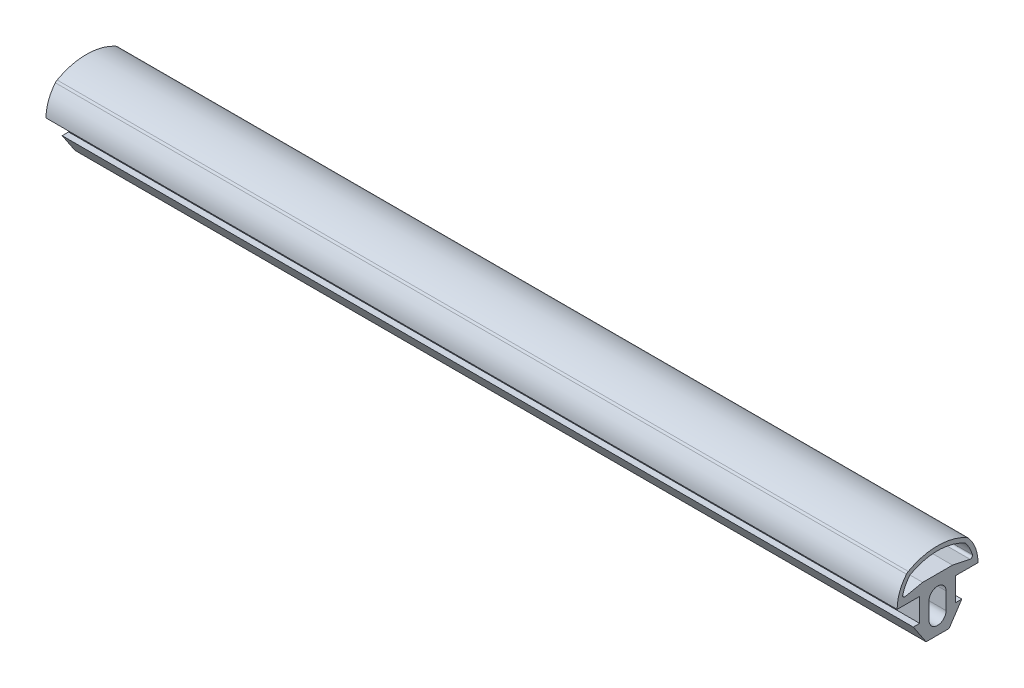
ISO-10303-21;
HEADER;
FILE_DESCRIPTION(('STEP AP214'),'2;1');
FILE_NAME('part.step','',(''),(''),'','','');
FILE_SCHEMA(('AUTOMOTIVE_DESIGN { 1 0 10303 214 1 1 1 1 }'));
ENDSEC;
DATA;
#1=APPLICATION_CONTEXT('core data for automotive mechanical design processes');
#2=APPLICATION_PROTOCOL_DEFINITION('international standard','automotive_design',2000,#1);
#3=PRODUCT_CONTEXT('',#1,'mechanical');
#4=PRODUCT('Part','Part','',(#3));
#5=PRODUCT_RELATED_PRODUCT_CATEGORY('part','',(#4));
#6=PRODUCT_DEFINITION_FORMATION('','',#4);
#7=PRODUCT_DEFINITION_CONTEXT('part definition',#1,'design');
#8=PRODUCT_DEFINITION('design','',#6,#7);
#9=PRODUCT_DEFINITION_SHAPE('','',#8);
#10=(LENGTH_UNIT() NAMED_UNIT(*) SI_UNIT(.MILLI.,.METRE.));
#11=(NAMED_UNIT(*) PLANE_ANGLE_UNIT() SI_UNIT($,.RADIAN.));
#12=(NAMED_UNIT(*) SI_UNIT($,.STERADIAN.) SOLID_ANGLE_UNIT());
#13=UNCERTAINTY_MEASURE_WITH_UNIT(LENGTH_MEASURE(1.E-05),#10,'distance_accuracy_value','');
#14=(GEOMETRIC_REPRESENTATION_CONTEXT(3) GLOBAL_UNCERTAINTY_ASSIGNED_CONTEXT((#13)) GLOBAL_UNIT_ASSIGNED_CONTEXT((#10,
#11,#12)) REPRESENTATION_CONTEXT('',''));
#15=CARTESIAN_POINT('',(0.,0.,0.));
#16=DIRECTION('',(0.,0.,1.));
#17=DIRECTION('',(1.,0.,0.));
#18=AXIS2_PLACEMENT_3D('',#15,#16,#17);
#19=CARTESIAN_POINT('',(200.,0.96558229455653,-0.262277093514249));
#20=DIRECTION('',(-1.,0.,0.));
#21=DIRECTION('',(0.,0.,1.));
#22=AXIS2_PLACEMENT_3D('',#19,#20,#21);
#23=CYLINDRICAL_SURFACE('',#22,9.49993572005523);
#24=CARTESIAN_POINT('',(0.,0.96558229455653,-0.262277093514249));
#25=DIRECTION('',(1.,0.,0.));
#26=DIRECTION('',(0.,0.,-1.));
#27=AXIS2_PLACEMENT_3D('',#24,#25,#26);
#28=CIRCLE('',#27,9.49993572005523);
#29=CARTESIAN_POINT('',(0.,0.965554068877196,-9.76221281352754));
#30=VERTEX_POINT('',#29);
#31=CARTESIAN_POINT('',(0.,7.03070570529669,-7.57412068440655));
#32=VERTEX_POINT('',#31);
#33=EDGE_CURVE('E372',#30,#32,#28,.T.);
#34=ORIENTED_EDGE('',*,*,#33,.T.);
#35=DIRECTION('',(-1.,0.,0.));
#36=VECTOR('',#35,1.);
#37=CARTESIAN_POINT('',(200.,7.03070570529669,-7.57412068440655));
#38=LINE('',#37,#36);
#39=CARTESIAN_POINT('',(200.,7.03070570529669,-7.57412068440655));
#40=VERTEX_POINT('',#39);
#41=EDGE_CURVE('E12',#40,#32,#38,.T.);
#42=ORIENTED_EDGE('',*,*,#41,.F.);
#43=CARTESIAN_POINT('',(200.,0.96558229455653,-0.262277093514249));
#44=DIRECTION('',(1.,0.,0.));
#45=DIRECTION('',(0.,0.,-1.));
#46=AXIS2_PLACEMENT_3D('',#43,#44,#45);
#47=CIRCLE('',#46,9.49993572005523);
#48=CARTESIAN_POINT('',(200.,0.965554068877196,-9.76221281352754));
#49=VERTEX_POINT('',#48);
#50=EDGE_CURVE('E561',#49,#40,#47,.T.);
#51=ORIENTED_EDGE('',*,*,#50,.F.);
#52=DIRECTION('',(-1.,0.,0.));
#53=VECTOR('',#52,1.);
#54=CARTESIAN_POINT('',(200.,0.965554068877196,-9.76221281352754));
#55=LINE('',#54,#53);
#56=EDGE_CURVE('E413',#49,#30,#55,.T.);
#57=ORIENTED_EDGE('',*,*,#56,.T.);
#58=EDGE_LOOP('',(#34,#42,#51,#57));
#59=FACE_BOUND('',#58,.T.);
#60=ADVANCED_FACE('F91',(#59),#23,.T.);
#61=CARTESIAN_POINT('',(200.,6.07291566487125,-6.41949850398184));
#62=DIRECTION('',(-1.,0.,0.));
#63=DIRECTION('',(0.,0.,1.));
#64=AXIS2_PLACEMENT_3D('',#61,#62,#63);
#65=CYLINDRICAL_SURFACE('',#64,1.50017137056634);
#66=CARTESIAN_POINT('',(0.,6.07291566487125,-6.41949850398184));
#67=DIRECTION('',(1.,0.,0.));
#68=DIRECTION('',(0.,0.,-1.));
#69=AXIS2_PLACEMENT_3D('',#66,#67,#68);
#70=CIRCLE('',#69,1.50017137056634);
#71=CARTESIAN_POINT('',(0.,7.38496389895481,-7.14685231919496));
#72=VERTEX_POINT('',#71);
#73=EDGE_CURVE('E376',#32,#72,#70,.T.);
#74=ORIENTED_EDGE('',*,*,#73,.T.);
#75=DIRECTION('',(-1.,0.,0.));
#76=VECTOR('',#75,1.);
#77=CARTESIAN_POINT('',(200.,7.38496389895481,-7.14685231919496));
#78=LINE('',#77,#76);
#79=CARTESIAN_POINT('',(200.,7.38496389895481,-7.14685231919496));
#80=VERTEX_POINT('',#79);
#81=EDGE_CURVE('E102',#80,#72,#78,.T.);
#82=ORIENTED_EDGE('',*,*,#81,.F.);
#83=CARTESIAN_POINT('',(200.,6.07291566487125,-6.41949850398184));
#84=DIRECTION('',(1.,0.,0.));
#85=DIRECTION('',(0.,0.,-1.));
#86=AXIS2_PLACEMENT_3D('',#83,#84,#85);
#87=CIRCLE('',#86,1.50017137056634);
#88=EDGE_CURVE('E564',#40,#80,#87,.T.);
#89=ORIENTED_EDGE('',*,*,#88,.F.);
#90=ORIENTED_EDGE('',*,*,#41,.T.);
#91=EDGE_LOOP('',(#74,#82,#89,#90));
#92=FACE_BOUND('',#91,.T.);
#93=ADVANCED_FACE('F620',(#92),#65,.T.);
#94=CARTESIAN_POINT('',(200.,-5.03444593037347,-0.262213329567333));
#95=DIRECTION('',(-1.,0.,0.));
#96=DIRECTION('',(0.,0.,1.));
#97=AXIS2_PLACEMENT_3D('',#94,#95,#96);
#98=CYLINDRICAL_SURFACE('',#97,14.1999998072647);
#99=CARTESIAN_POINT('',(0.,-5.03444593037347,-0.262213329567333));
#100=DIRECTION('',(1.,0.,0.));
#101=DIRECTION('',(0.,0.,-1.));
#102=AXIS2_PLACEMENT_3D('',#99,#100,#101);
#103=CIRCLE('',#102,14.1999998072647);
#104=CARTESIAN_POINT('',(0.,7.38496286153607,6.62242753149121));
#105=VERTEX_POINT('',#104);
#106=EDGE_CURVE('E379',#72,#105,#103,.T.);
#107=ORIENTED_EDGE('',*,*,#106,.T.);
#108=DIRECTION('',(-1.,0.,0.));
#109=VECTOR('',#108,1.);
#110=CARTESIAN_POINT('',(200.,7.38496286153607,6.62242753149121));
#111=LINE('',#110,#109);
#112=CARTESIAN_POINT('',(200.,7.38496286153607,6.62242753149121));
#113=VERTEX_POINT('',#112);
#114=EDGE_CURVE('E449',#113,#105,#111,.T.);
#115=ORIENTED_EDGE('',*,*,#114,.F.);
#116=CARTESIAN_POINT('',(200.,-5.03444593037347,-0.262213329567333));
#117=DIRECTION('',(1.,0.,0.));
#118=DIRECTION('',(0.,0.,-1.));
#119=AXIS2_PLACEMENT_3D('',#116,#117,#118);
#120=CIRCLE('',#119,14.1999998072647);
#121=EDGE_CURVE('E567',#80,#113,#120,.T.);
#122=ORIENTED_EDGE('',*,*,#121,.F.);
#123=ORIENTED_EDGE('',*,*,#81,.T.);
#124=EDGE_LOOP('',(#107,#115,#122,#123));
#125=FACE_BOUND('',#124,.T.);
#126=ADVANCED_FACE('F625',(#125),#98,.T.);
#127=CARTESIAN_POINT('',(200.,6.07313879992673,5.89524695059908));
#128=DIRECTION('',(-1.,0.,0.));
#129=DIRECTION('',(0.,0.,1.));
#130=AXIS2_PLACEMENT_3D('',#127,#128,#129);
#131=CYLINDRICAL_SURFACE('',#130,1.49989131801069);
#132=CARTESIAN_POINT('',(0.,6.07313879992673,5.89524695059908));
#133=DIRECTION('',(1.,0.,0.));
#134=DIRECTION('',(0.,0.,-1.));
#135=AXIS2_PLACEMENT_3D('',#132,#133,#134);
#136=CIRCLE('',#135,1.49989131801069);
#137=CARTESIAN_POINT('',(0.,7.03070963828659,7.04968709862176));
#138=VERTEX_POINT('',#137);
#139=EDGE_CURVE('E382',#105,#138,#136,.T.);
#140=ORIENTED_EDGE('',*,*,#139,.T.);
#141=DIRECTION('',(-1.,0.,0.));
#142=VECTOR('',#141,1.);
#143=CARTESIAN_POINT('',(200.,7.03070963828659,7.04968709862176));
#144=LINE('',#143,#142);
#145=CARTESIAN_POINT('',(200.,7.03070963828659,7.04968709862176));
#146=VERTEX_POINT('',#145);
#147=EDGE_CURVE('E445',#146,#138,#144,.T.);
#148=ORIENTED_EDGE('',*,*,#147,.F.);
#149=CARTESIAN_POINT('',(200.,6.07313879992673,5.89524695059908));
#150=DIRECTION('',(1.,0.,0.));
#151=DIRECTION('',(0.,0.,-1.));
#152=AXIS2_PLACEMENT_3D('',#149,#150,#151);
#153=CIRCLE('',#152,1.49989131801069);
#154=EDGE_CURVE('E570',#113,#146,#153,.T.);
#155=ORIENTED_EDGE('',*,*,#154,.F.);
#156=ORIENTED_EDGE('',*,*,#114,.T.);
#157=EDGE_LOOP('',(#140,#148,#155,#156));
#158=FACE_BOUND('',#157,.T.);
#159=ADVANCED_FACE('F774',(#158),#131,.T.);
#160=CARTESIAN_POINT('',(200.,0.965554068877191,-0.262213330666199));
#161=DIRECTION('',(-1.,0.,0.));
#162=DIRECTION('',(0.,0.,1.));
#163=AXIS2_PLACEMENT_3D('',#160,#161,#162);
#164=CYLINDRICAL_SURFACE('',#163,9.49999999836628);
#165=CARTESIAN_POINT('',(0.,0.965554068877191,-0.262213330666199));
#166=DIRECTION('',(1.,0.,0.));
#167=DIRECTION('',(0.,0.,-1.));
#168=AXIS2_PLACEMENT_3D('',#165,#166,#167);
#169=CIRCLE('',#168,9.49999999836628);
#170=CARTESIAN_POINT('',(0.,0.965554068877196,9.23778666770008));
#171=VERTEX_POINT('',#170);
#172=EDGE_CURVE('E385',#138,#171,#169,.T.);
#173=ORIENTED_EDGE('',*,*,#172,.T.);
#174=DIRECTION('',(-1.,0.,0.));
#175=VECTOR('',#174,1.);
#176=CARTESIAN_POINT('',(200.,0.965554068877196,9.23778666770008));
#177=LINE('',#176,#175);
#178=CARTESIAN_POINT('',(200.,0.965554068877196,9.23778666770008));
#179=VERTEX_POINT('',#178);
#180=EDGE_CURVE('E441',#179,#171,#177,.T.);
#181=ORIENTED_EDGE('',*,*,#180,.F.);
#182=CARTESIAN_POINT('',(200.,0.965554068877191,-0.262213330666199));
#183=DIRECTION('',(1.,0.,0.));
#184=DIRECTION('',(0.,0.,-1.));
#185=AXIS2_PLACEMENT_3D('',#182,#183,#184);
#186=CIRCLE('',#185,9.49999999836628);
#187=EDGE_CURVE('E573',#146,#179,#186,.T.);
#188=ORIENTED_EDGE('',*,*,#187,.F.);
#189=ORIENTED_EDGE('',*,*,#147,.T.);
#190=EDGE_LOOP('',(#173,#181,#188,#189));
#191=FACE_BOUND('',#190,.T.);
#192=ADVANCED_FACE('F766',(#191),#164,.T.);
#193=CARTESIAN_POINT('',(200.,0.965554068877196,9.23778666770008));
#194=DIRECTION('',(0.,1.,0.));
#195=DIRECTION('',(0.,0.,1.));
#196=AXIS2_PLACEMENT_3D('',#193,#194,#195);
#197=PLANE('',#196);
#198=DIRECTION('',(0.,0.,-1.));
#199=VECTOR('',#198,1.);
#200=CARTESIAN_POINT('',(0.,0.965554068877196,9.23778666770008));
#201=LINE('',#200,#199);
#202=CARTESIAN_POINT('',(0.,0.965554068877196,3.93778361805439));
#203=VERTEX_POINT('',#202);
#204=EDGE_CURVE('E388',#171,#203,#201,.T.);
#205=ORIENTED_EDGE('',*,*,#204,.T.);
#206=DIRECTION('',(-1.,0.,0.));
#207=VECTOR('',#206,1.);
#208=CARTESIAN_POINT('',(200.,0.965554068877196,3.93778361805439));
#209=LINE('',#208,#207);
#210=CARTESIAN_POINT('',(200.,0.965554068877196,3.93778361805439));
#211=VERTEX_POINT('',#210);
#212=EDGE_CURVE('E437',#211,#203,#209,.T.);
#213=ORIENTED_EDGE('',*,*,#212,.F.);
#214=DIRECTION('',(0.,0.,-1.));
#215=VECTOR('',#214,1.);
#216=CARTESIAN_POINT('',(200.,0.965554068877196,9.23778666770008));
#217=LINE('',#216,#215);
#218=EDGE_CURVE('E576',#179,#211,#217,.T.);
#219=ORIENTED_EDGE('',*,*,#218,.F.);
#220=ORIENTED_EDGE('',*,*,#180,.T.);
#221=EDGE_LOOP('',(#205,#213,#219,#220));
#222=FACE_BOUND('',#221,.T.);
#223=ADVANCED_FACE('F758',(#222),#197,.F.);
#224=CARTESIAN_POINT('',(200.,0.965554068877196,3.93778361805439));
#225=DIRECTION('',(0.,0.,-1.));
#226=DIRECTION('',(-1.,0.,0.));
#227=AXIS2_PLACEMENT_3D('',#224,#225,#226);
#228=PLANE('',#227);
#229=DIRECTION('',(0.,-1.,0.));
#230=VECTOR('',#229,1.);
#231=CARTESIAN_POINT('',(0.,0.965554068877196,3.93778361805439));
#232=LINE('',#231,#230);
#233=CARTESIAN_POINT('',(0.,-4.5344459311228,3.93778361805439));
#234=VERTEX_POINT('',#233);
#235=EDGE_CURVE('E391',#203,#234,#232,.T.);
#236=ORIENTED_EDGE('',*,*,#235,.T.);
#237=DIRECTION('',(-1.,0.,0.));
#238=VECTOR('',#237,1.);
#239=CARTESIAN_POINT('',(200.,-4.5344459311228,3.93778361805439));
#240=LINE('',#239,#238);
#241=CARTESIAN_POINT('',(200.,-4.5344459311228,3.93778361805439));
#242=VERTEX_POINT('',#241);
#243=EDGE_CURVE('E433',#242,#234,#240,.T.);
#244=ORIENTED_EDGE('',*,*,#243,.F.);
#245=DIRECTION('',(0.,-1.,0.));
#246=VECTOR('',#245,1.);
#247=CARTESIAN_POINT('',(200.,0.965554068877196,3.93778361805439));
#248=LINE('',#247,#246);
#249=EDGE_CURVE('E579',#211,#242,#248,.T.);
#250=ORIENTED_EDGE('',*,*,#249,.F.);
#251=ORIENTED_EDGE('',*,*,#212,.T.);
#252=EDGE_LOOP('',(#236,#244,#250,#251));
#253=FACE_BOUND('',#252,.T.);
#254=ADVANCED_FACE('F750',(#253),#228,.F.);
#255=CARTESIAN_POINT('',(200.,-4.5344459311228,3.93778361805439));
#256=DIRECTION('',(0.,-1.,0.));
#257=DIRECTION('',(0.,0.,-1.));
#258=AXIS2_PLACEMENT_3D('',#255,#256,#257);
#259=PLANE('',#258);
#260=DIRECTION('',(0.,0.,1.));
#261=VECTOR('',#260,1.);
#262=CARTESIAN_POINT('',(0.,-4.5344459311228,3.93778361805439));
#263=LINE('',#262,#261);
#264=CARTESIAN_POINT('',(0.,-4.5344459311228,5.43778361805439));
#265=VERTEX_POINT('',#264);
#266=EDGE_CURVE('E394',#234,#265,#263,.T.);
#267=ORIENTED_EDGE('',*,*,#266,.T.);
#268=DIRECTION('',(-1.,0.,0.));
#269=VECTOR('',#268,1.);
#270=CARTESIAN_POINT('',(200.,-4.5344459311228,5.43778361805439));
#271=LINE('',#270,#269);
#272=CARTESIAN_POINT('',(200.,-4.5344459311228,5.43778361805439));
#273=VERTEX_POINT('',#272);
#274=EDGE_CURVE('E429',#273,#265,#271,.T.);
#275=ORIENTED_EDGE('',*,*,#274,.F.);
#276=DIRECTION('',(0.,0.,1.));
#277=VECTOR('',#276,1.);
#278=CARTESIAN_POINT('',(200.,-4.5344459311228,3.93778361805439));
#279=LINE('',#278,#277);
#280=EDGE_CURVE('E582',#242,#273,#279,.T.);
#281=ORIENTED_EDGE('',*,*,#280,.F.);
#282=ORIENTED_EDGE('',*,*,#243,.T.);
#283=EDGE_LOOP('',(#267,#275,#281,#282));
#284=FACE_BOUND('',#283,.T.);
#285=ADVANCED_FACE('F742',(#284),#259,.F.);
#286=CARTESIAN_POINT('',(200.,-4.5344459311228,5.43778361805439));
#287=DIRECTION('',(0.,0.554700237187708,-0.832050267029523));
#288=DIRECTION('',(0.,0.832050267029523,0.554700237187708));
#289=AXIS2_PLACEMENT_3D('',#286,#287,#288);
#290=PLANE('',#289);
#291=DIRECTION('',(0.,-0.832050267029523,-0.554700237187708));
#292=VECTOR('',#291,1.);
#293=CARTESIAN_POINT('',(0.,-4.5344459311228,5.43778361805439));
#294=LINE('',#293,#292);
#295=CARTESIAN_POINT('',(0.,-9.0344454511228,2.43778361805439));
#296=VERTEX_POINT('',#295);
#297=EDGE_CURVE('E397',#265,#296,#294,.T.);
#298=ORIENTED_EDGE('',*,*,#297,.T.);
#299=DIRECTION('',(-1.,0.,0.));
#300=VECTOR('',#299,1.);
#301=CARTESIAN_POINT('',(200.,-9.0344454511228,2.43778361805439));
#302=LINE('',#301,#300);
#303=CARTESIAN_POINT('',(200.,-9.0344454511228,2.43778361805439));
#304=VERTEX_POINT('',#303);
#305=EDGE_CURVE('E425',#304,#296,#302,.T.);
#306=ORIENTED_EDGE('',*,*,#305,.F.);
#307=DIRECTION('',(0.,-0.832050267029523,-0.554700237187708));
#308=VECTOR('',#307,1.);
#309=CARTESIAN_POINT('',(200.,-4.5344459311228,5.43778361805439));
#310=LINE('',#309,#308);
#311=EDGE_CURVE('E585',#273,#304,#310,.T.);
#312=ORIENTED_EDGE('',*,*,#311,.F.);
#313=ORIENTED_EDGE('',*,*,#274,.T.);
#314=EDGE_LOOP('',(#298,#306,#312,#313));
#315=FACE_BOUND('',#314,.T.);
#316=ADVANCED_FACE('F735',(#315),#290,.F.);
#317=CARTESIAN_POINT('',(200.,-9.0344454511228,2.43778361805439));
#318=DIRECTION('',(0.,1.,0.));
#319=DIRECTION('',(0.,0.,1.));
#320=AXIS2_PLACEMENT_3D('',#317,#318,#319);
#321=PLANE('',#320);
#322=DIRECTION('',(0.,0.,-1.));
#323=VECTOR('',#322,1.);
#324=CARTESIAN_POINT('',(0.,-9.0344454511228,2.43778361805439));
#325=LINE('',#324,#323);
#326=CARTESIAN_POINT('',(0.,-9.0344454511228,-2.96220265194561));
#327=VERTEX_POINT('',#326);
#328=EDGE_CURVE('E400',#296,#327,#325,.T.);
#329=ORIENTED_EDGE('',*,*,#328,.T.);
#330=DIRECTION('',(-1.,0.,0.));
#331=VECTOR('',#330,1.);
#332=CARTESIAN_POINT('',(200.,-9.0344454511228,-2.96220265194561));
#333=LINE('',#332,#331);
#334=CARTESIAN_POINT('',(200.,-9.0344454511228,-2.96220265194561));
#335=VERTEX_POINT('',#334);
#336=EDGE_CURVE('E421',#335,#327,#333,.T.);
#337=ORIENTED_EDGE('',*,*,#336,.F.);
#338=DIRECTION('',(0.,0.,-1.));
#339=VECTOR('',#338,1.);
#340=CARTESIAN_POINT('',(200.,-9.0344454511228,2.43778361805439));
#341=LINE('',#340,#339);
#342=EDGE_CURVE('E588',#304,#335,#341,.T.);
#343=ORIENTED_EDGE('',*,*,#342,.F.);
#344=ORIENTED_EDGE('',*,*,#305,.T.);
#345=EDGE_LOOP('',(#329,#337,#343,#344));
#346=FACE_BOUND('',#345,.T.);
#347=ADVANCED_FACE('F596',(#346),#321,.F.);
#348=CARTESIAN_POINT('',(200.,-9.0344454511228,-2.96220265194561));
#349=DIRECTION('',(0.,0.554700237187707,0.832050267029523));
#350=DIRECTION('',(0.,-0.832050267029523,0.554700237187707));
#351=AXIS2_PLACEMENT_3D('',#348,#349,#350);
#352=PLANE('',#351);
#353=DIRECTION('',(0.,0.832050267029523,-0.554700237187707));
#354=VECTOR('',#353,1.);
#355=CARTESIAN_POINT('',(0.,-9.0344454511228,-2.96220265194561));
#356=LINE('',#355,#354);
#357=CARTESIAN_POINT('',(0.,-4.5344459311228,-5.96220265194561));
#358=VERTEX_POINT('',#357);
#359=EDGE_CURVE('E403',#327,#358,#356,.T.);
#360=ORIENTED_EDGE('',*,*,#359,.T.);
#361=DIRECTION('',(-1.,0.,0.));
#362=VECTOR('',#361,1.);
#363=CARTESIAN_POINT('',(200.,-4.5344459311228,-5.96220265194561));
#364=LINE('',#363,#362);
#365=CARTESIAN_POINT('',(200.,-4.5344459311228,-5.96220265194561));
#366=VERTEX_POINT('',#365);
#367=EDGE_CURVE('E305',#366,#358,#364,.T.);
#368=ORIENTED_EDGE('',*,*,#367,.F.);
#369=DIRECTION('',(0.,0.832050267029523,-0.554700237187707));
#370=VECTOR('',#369,1.);
#371=CARTESIAN_POINT('',(200.,-9.0344454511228,-2.96220265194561));
#372=LINE('',#371,#370);
#373=EDGE_CURVE('E294',#335,#366,#372,.T.);
#374=ORIENTED_EDGE('',*,*,#373,.F.);
#375=ORIENTED_EDGE('',*,*,#336,.T.);
#376=EDGE_LOOP('',(#360,#368,#374,#375));
#377=FACE_BOUND('',#376,.T.);
#378=ADVANCED_FACE('F600',(#377),#352,.F.);
#379=CARTESIAN_POINT('',(200.,-4.5344459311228,-5.96220265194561));
#380=DIRECTION('',(0.,-1.,0.));
#381=DIRECTION('',(0.,0.,-1.));
#382=AXIS2_PLACEMENT_3D('',#379,#380,#381);
#383=PLANE('',#382);
#384=DIRECTION('',(0.,0.,1.));
#385=VECTOR('',#384,1.);
#386=CARTESIAN_POINT('',(0.,-4.5344459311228,-5.96220265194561));
#387=LINE('',#386,#385);
#388=CARTESIAN_POINT('',(0.,-4.5344459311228,-4.46220265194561));
#389=VERTEX_POINT('',#388);
#390=EDGE_CURVE('E303',#358,#389,#387,.T.);
#391=ORIENTED_EDGE('',*,*,#390,.T.);
#392=DIRECTION('',(-1.,0.,0.));
#393=VECTOR('',#392,1.);
#394=CARTESIAN_POINT('',(200.,-4.5344459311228,-4.46220265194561));
#395=LINE('',#394,#393);
#396=CARTESIAN_POINT('',(200.,-4.5344459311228,-4.46220265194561));
#397=VERTEX_POINT('',#396);
#398=EDGE_CURVE('E300',#397,#389,#395,.T.);
#399=ORIENTED_EDGE('',*,*,#398,.F.);
#400=DIRECTION('',(0.,0.,1.));
#401=VECTOR('',#400,1.);
#402=CARTESIAN_POINT('',(200.,-4.5344459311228,-5.96220265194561));
#403=LINE('',#402,#401);
#404=EDGE_CURVE('E288',#366,#397,#403,.T.);
#405=ORIENTED_EDGE('',*,*,#404,.F.);
#406=ORIENTED_EDGE('',*,*,#367,.T.);
#407=EDGE_LOOP('',(#391,#399,#405,#406));
#408=FACE_BOUND('',#407,.T.);
#409=ADVANCED_FACE('F301',(#408),#383,.F.);
#410=CARTESIAN_POINT('',(200.,-4.5344459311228,-4.46220265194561));
#411=DIRECTION('',(0.,0.,1.));
#412=DIRECTION('',(1.,0.,0.));
#413=AXIS2_PLACEMENT_3D('',#410,#411,#412);
#414=PLANE('',#413);
#415=DIRECTION('',(0.,1.,0.));
#416=VECTOR('',#415,1.);
#417=CARTESIAN_POINT('',(0.,-4.5344459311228,-4.46220265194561));
#418=LINE('',#417,#416);
#419=CARTESIAN_POINT('',(0.,0.965554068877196,-4.46220265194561));
#420=VERTEX_POINT('',#419);
#421=EDGE_CURVE('E200',#389,#420,#418,.T.);
#422=ORIENTED_EDGE('',*,*,#421,.T.);
#423=DIRECTION('',(-1.,0.,0.));
#424=VECTOR('',#423,1.);
#425=CARTESIAN_POINT('',(200.,0.965554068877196,-4.46220265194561));
#426=LINE('',#425,#424);
#427=CARTESIAN_POINT('',(200.,0.965554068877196,-4.46220265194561));
#428=VERTEX_POINT('',#427);
#429=EDGE_CURVE('E306',#428,#420,#426,.T.);
#430=ORIENTED_EDGE('',*,*,#429,.F.);
#431=DIRECTION('',(0.,1.,0.));
#432=VECTOR('',#431,1.);
#433=CARTESIAN_POINT('',(200.,-4.5344459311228,-4.46220265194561));
#434=LINE('',#433,#432);
#435=EDGE_CURVE('E292',#397,#428,#434,.T.);
#436=ORIENTED_EDGE('',*,*,#435,.F.);
#437=ORIENTED_EDGE('',*,*,#398,.T.);
#438=EDGE_LOOP('',(#422,#430,#436,#437));
#439=FACE_BOUND('',#438,.T.);
#440=ADVANCED_FACE('F308',(#439),#414,.F.);
#441=CARTESIAN_POINT('',(200.,3.46555408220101,-3.76220567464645));
#442=DIRECTION('',(0.,1.,0.));
#443=DIRECTION('',(0.,0.,1.));
#444=AXIS2_PLACEMENT_3D('',#441,#442,#443);
#445=PLANE('',#444);
#446=DIRECTION('',(0.,0.,-1.));
#447=VECTOR('',#446,1.);
#448=CARTESIAN_POINT('',(0.,3.46555408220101,-3.76220567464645));
#449=LINE('',#448,#447);
#450=CARTESIAN_POINT('',(0.,3.46555408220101,3.23778669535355));
#451=VERTEX_POINT('',#450);
#452=CARTESIAN_POINT('',(0.,3.46555408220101,-3.76220567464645));
#453=VERTEX_POINT('',#452);
#454=EDGE_CURVE('E332',#451,#453,#449,.T.);
#455=ORIENTED_EDGE('',*,*,#454,.F.);
#456=DIRECTION('',(-1.,0.,0.));
#457=VECTOR('',#456,1.);
#458=CARTESIAN_POINT('',(200.,3.46555408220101,3.23778669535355));
#459=LINE('',#458,#457);
#460=CARTESIAN_POINT('',(200.,3.46555408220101,3.23778669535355));
#461=VERTEX_POINT('',#460);
#462=EDGE_CURVE('E416',#461,#451,#459,.T.);
#463=ORIENTED_EDGE('',*,*,#462,.F.);
#464=DIRECTION('',(0.,0.,-1.));
#465=VECTOR('',#464,1.);
#466=CARTESIAN_POINT('',(200.,3.46555408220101,-3.76220567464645));
#467=LINE('',#466,#465);
#468=CARTESIAN_POINT('',(200.,3.46555408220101,-3.76220567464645));
#469=VERTEX_POINT('',#468);
#470=EDGE_CURVE('E518',#461,#469,#467,.T.);
#471=ORIENTED_EDGE('',*,*,#470,.T.);
#472=DIRECTION('',(-1.,0.,0.));
#473=VECTOR('',#472,1.);
#474=CARTESIAN_POINT('',(200.,3.46555408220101,-3.76220567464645));
#475=LINE('',#474,#473);
#476=EDGE_CURVE('E456',#469,#453,#475,.T.);
#477=ORIENTED_EDGE('',*,*,#476,.T.);
#478=EDGE_LOOP('',(#455,#463,#471,#477));
#479=FACE_BOUND('',#478,.T.);
#480=ADVANCED_FACE('F664',(#479),#445,.T.);
#481=CARTESIAN_POINT('',(200.,3.46555408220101,3.23778669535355));
#482=DIRECTION('',(0.,0.979534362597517,0.201277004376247));
#483=DIRECTION('',(0.,-0.201277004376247,0.979534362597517));
#484=AXIS2_PLACEMENT_3D('',#481,#482,#483);
#485=PLANE('',#484);
#486=DIRECTION('',(0.,0.201277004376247,-0.979534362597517));
#487=VECTOR('',#486,1.);
#488=CARTESIAN_POINT('',(0.,3.46555408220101,3.23778669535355));
#489=LINE('',#488,#487);
#490=CARTESIAN_POINT('',(0.,2.62181170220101,7.34394207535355));
#491=VERTEX_POINT('',#490);
#492=EDGE_CURVE('E336',#491,#451,#489,.T.);
#493=ORIENTED_EDGE('',*,*,#492,.F.);
#494=DIRECTION('',(-1.,0.,0.));
#495=VECTOR('',#494,1.);
#496=CARTESIAN_POINT('',(200.,2.62181170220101,7.34394207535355));
#497=LINE('',#496,#495);
#498=CARTESIAN_POINT('',(200.,2.62181170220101,7.34394207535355));
#499=VERTEX_POINT('',#498);
#500=EDGE_CURVE('E480',#499,#491,#497,.T.);
#501=ORIENTED_EDGE('',*,*,#500,.F.);
#502=DIRECTION('',(0.,0.201277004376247,-0.979534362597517));
#503=VECTOR('',#502,1.);
#504=CARTESIAN_POINT('',(200.,3.46555408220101,3.23778669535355));
#505=LINE('',#504,#503);
#506=EDGE_CURVE('E522',#499,#461,#505,.T.);
#507=ORIENTED_EDGE('',*,*,#506,.T.);
#508=ORIENTED_EDGE('',*,*,#462,.T.);
#509=EDGE_LOOP('',(#493,#501,#507,#508));
#510=FACE_BOUND('',#509,.T.);
#511=ADVANCED_FACE('F660',(#510),#485,.T.);
#512=CARTESIAN_POINT('',(200.,3.11158095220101,7.44457327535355));
#513=DIRECTION('',(-1.,0.,0.));
#514=DIRECTION('',(0.,0.,1.));
#515=AXIS2_PLACEMENT_3D('',#512,#513,#514);
#516=CYLINDRICAL_SURFACE('',#515,0.500000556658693);
#517=CARTESIAN_POINT('',(0.,3.11158095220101,7.44457327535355));
#518=DIRECTION('',(1.,0.,0.));
#519=DIRECTION('',(0.,0.,-1.));
#520=AXIS2_PLACEMENT_3D('',#517,#518,#519);
#521=CIRCLE('',#520,0.500000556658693);
#522=CARTESIAN_POINT('',(0.,3.24570563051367,7.92624860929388));
#523=VERTEX_POINT('',#522);
#524=EDGE_CURVE('E340',#523,#491,#521,.T.);
#525=ORIENTED_EDGE('',*,*,#524,.F.);
#526=DIRECTION('',(-1.,0.,0.));
#527=VECTOR('',#526,1.);
#528=CARTESIAN_POINT('',(200.,3.24570563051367,7.92624860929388));
#529=LINE('',#528,#527);
#530=CARTESIAN_POINT('',(200.,3.24570563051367,7.92624860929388));
#531=VERTEX_POINT('',#530);
#532=EDGE_CURVE('E477',#531,#523,#529,.T.);
#533=ORIENTED_EDGE('',*,*,#532,.F.);
#534=CARTESIAN_POINT('',(200.,3.11158095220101,7.44457327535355));
#535=DIRECTION('',(1.,0.,0.));
#536=DIRECTION('',(0.,0.,-1.));
#537=AXIS2_PLACEMENT_3D('',#534,#535,#536);
#538=CIRCLE('',#537,0.500000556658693);
#539=EDGE_CURVE('E529',#531,#499,#538,.T.);
#540=ORIENTED_EDGE('',*,*,#539,.T.);
#541=ORIENTED_EDGE('',*,*,#500,.T.);
#542=EDGE_LOOP('',(#525,#533,#540,#541));
#543=FACE_BOUND('',#542,.T.);
#544=ADVANCED_FACE('F656',(#543),#516,.F.);
#545=CARTESIAN_POINT('',(200.,0.965554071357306,-0.262213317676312));
#546=DIRECTION('',(-1.,0.,0.));
#547=DIRECTION('',(0.,0.,1.));
#548=AXIS2_PLACEMENT_3D('',#545,#546,#547);
#549=CYLINDRICAL_SURFACE('',#548,8.49999999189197);
#550=CARTESIAN_POINT('',(0.,0.965554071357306,-0.262213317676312));
#551=DIRECTION('',(1.,0.,0.));
#552=DIRECTION('',(0.,0.,-1.));
#553=AXIS2_PLACEMENT_3D('',#550,#551,#552);
#554=CIRCLE('',#553,8.49999999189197);
#555=CARTESIAN_POINT('',(0.,6.39227220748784,6.28001337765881));
#556=VERTEX_POINT('',#555);
#557=EDGE_CURVE('E344',#556,#523,#554,.T.);
#558=ORIENTED_EDGE('',*,*,#557,.F.);
#559=DIRECTION('',(-1.,0.,0.));
#560=VECTOR('',#559,1.);
#561=CARTESIAN_POINT('',(200.,6.39227220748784,6.28001337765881));
#562=LINE('',#561,#560);
#563=CARTESIAN_POINT('',(200.,6.39227220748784,6.28001337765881));
#564=VERTEX_POINT('',#563);
#565=EDGE_CURVE('E474',#564,#556,#562,.T.);
#566=ORIENTED_EDGE('',*,*,#565,.F.);
#567=CARTESIAN_POINT('',(200.,0.965554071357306,-0.262213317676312));
#568=DIRECTION('',(1.,0.,0.));
#569=DIRECTION('',(0.,0.,-1.));
#570=AXIS2_PLACEMENT_3D('',#567,#568,#569);
#571=CIRCLE('',#570,8.49999999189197);
#572=EDGE_CURVE('E533',#564,#531,#571,.T.);
#573=ORIENTED_EDGE('',*,*,#572,.T.);
#574=ORIENTED_EDGE('',*,*,#532,.T.);
#575=EDGE_LOOP('',(#558,#566,#573,#574));
#576=FACE_BOUND('',#575,.T.);
#577=ADVANCED_FACE('F652',(#576),#549,.F.);
#578=CARTESIAN_POINT('',(200.,6.07313879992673,5.89524695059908));
#579=DIRECTION('',(-1.,0.,0.));
#580=DIRECTION('',(0.,0.,1.));
#581=AXIS2_PLACEMENT_3D('',#578,#579,#580);
#582=CYLINDRICAL_SURFACE('',#581,0.499891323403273);
#583=CARTESIAN_POINT('',(0.,6.07313879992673,5.89524695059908));
#584=DIRECTION('',(1.,0.,0.));
#585=DIRECTION('',(0.,0.,-1.));
#586=AXIS2_PLACEMENT_3D('',#583,#584,#585);
#587=CIRCLE('',#586,0.499891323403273);
#588=CARTESIAN_POINT('',(0.,6.51035659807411,6.13759366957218));
#589=VERTEX_POINT('',#588);
#590=EDGE_CURVE('E348',#589,#556,#587,.T.);
#591=ORIENTED_EDGE('',*,*,#590,.F.);
#592=DIRECTION('',(-1.,0.,0.));
#593=VECTOR('',#592,1.);
#594=CARTESIAN_POINT('',(200.,6.51035659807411,6.13759366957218));
#595=LINE('',#594,#593);
#596=CARTESIAN_POINT('',(200.,6.51035659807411,6.13759366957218));
#597=VERTEX_POINT('',#596);
#598=EDGE_CURVE('E471',#597,#589,#595,.T.);
#599=ORIENTED_EDGE('',*,*,#598,.F.);
#600=CARTESIAN_POINT('',(200.,6.07313879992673,5.89524695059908));
#601=DIRECTION('',(1.,0.,0.));
#602=DIRECTION('',(0.,0.,-1.));
#603=AXIS2_PLACEMENT_3D('',#600,#601,#602);
#604=CIRCLE('',#603,0.499891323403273);
#605=EDGE_CURVE('E537',#597,#564,#604,.T.);
#606=ORIENTED_EDGE('',*,*,#605,.T.);
#607=ORIENTED_EDGE('',*,*,#565,.T.);
#608=EDGE_LOOP('',(#591,#599,#606,#607));
#609=FACE_BOUND('',#608,.T.);
#610=ADVANCED_FACE('F648',(#609),#582,.F.);
#611=CARTESIAN_POINT('',(200.,-5.03445135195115,-0.262210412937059));
#612=DIRECTION('',(-1.,0.,0.));
#613=DIRECTION('',(0.,0.,1.));
#614=AXIS2_PLACEMENT_3D('',#611,#612,#613);
#615=CYLINDRICAL_SURFACE('',#614,13.2000031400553);
#616=CARTESIAN_POINT('',(0.,-5.03445135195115,-0.262210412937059));
#617=DIRECTION('',(1.,0.,0.));
#618=DIRECTION('',(0.,0.,-1.));
#619=AXIS2_PLACEMENT_3D('',#616,#617,#618);
#620=CIRCLE('',#619,13.2000031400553);
#621=CARTESIAN_POINT('',(0.,6.51035434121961,-6.66201856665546));
#622=VERTEX_POINT('',#621);
#623=EDGE_CURVE('E352',#622,#589,#620,.T.);
#624=ORIENTED_EDGE('',*,*,#623,.F.);
#625=DIRECTION('',(-1.,0.,0.));
#626=VECTOR('',#625,1.);
#627=CARTESIAN_POINT('',(200.,6.51035434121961,-6.66201856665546));
#628=LINE('',#627,#626);
#629=CARTESIAN_POINT('',(200.,6.51035434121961,-6.66201856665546));
#630=VERTEX_POINT('',#629);
#631=EDGE_CURVE('E468',#630,#622,#628,.T.);
#632=ORIENTED_EDGE('',*,*,#631,.F.);
#633=CARTESIAN_POINT('',(200.,-5.03445135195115,-0.262210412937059));
#634=DIRECTION('',(1.,0.,0.));
#635=DIRECTION('',(0.,0.,-1.));
#636=AXIS2_PLACEMENT_3D('',#633,#634,#635);
#637=CIRCLE('',#636,13.2000031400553);
#638=EDGE_CURVE('E541',#630,#597,#637,.T.);
#639=ORIENTED_EDGE('',*,*,#638,.T.);
#640=ORIENTED_EDGE('',*,*,#598,.T.);
#641=EDGE_LOOP('',(#624,#632,#639,#640));
#642=FACE_BOUND('',#641,.T.);
#643=ADVANCED_FACE('F644',(#642),#615,.F.);
#644=CARTESIAN_POINT('',(200.,6.07291566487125,-6.41949850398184));
#645=DIRECTION('',(-1.,0.,0.));
#646=DIRECTION('',(0.,0.,1.));
#647=AXIS2_PLACEMENT_3D('',#644,#645,#646);
#648=CYLINDRICAL_SURFACE('',#647,0.500168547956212);
#649=CARTESIAN_POINT('',(0.,6.07291566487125,-6.41949850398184));
#650=DIRECTION('',(1.,0.,0.));
#651=DIRECTION('',(0.,0.,-1.));
#652=AXIS2_PLACEMENT_3D('',#649,#650,#651);
#653=CIRCLE('',#652,0.500168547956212);
#654=CARTESIAN_POINT('',(0.,6.39227242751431,-6.80443984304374));
#655=VERTEX_POINT('',#654);
#656=EDGE_CURVE('E356',#655,#622,#653,.T.);
#657=ORIENTED_EDGE('',*,*,#656,.F.);
#658=DIRECTION('',(-1.,0.,0.));
#659=VECTOR('',#658,1.);
#660=CARTESIAN_POINT('',(200.,6.39227242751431,-6.80443984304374));
#661=LINE('',#660,#659);
#662=CARTESIAN_POINT('',(200.,6.39227242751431,-6.80443984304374));
#663=VERTEX_POINT('',#662);
#664=EDGE_CURVE('E465',#663,#655,#661,.T.);
#665=ORIENTED_EDGE('',*,*,#664,.F.);
#666=CARTESIAN_POINT('',(200.,6.07291566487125,-6.41949850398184));
#667=DIRECTION('',(1.,0.,0.));
#668=DIRECTION('',(0.,0.,-1.));
#669=AXIS2_PLACEMENT_3D('',#666,#667,#668);
#670=CIRCLE('',#669,0.500168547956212);
#671=EDGE_CURVE('E545',#663,#630,#670,.T.);
#672=ORIENTED_EDGE('',*,*,#671,.T.);
#673=ORIENTED_EDGE('',*,*,#631,.T.);
#674=EDGE_LOOP('',(#657,#665,#672,#673));
#675=FACE_BOUND('',#674,.T.);
#676=ADVANCED_FACE('F640',(#675),#648,.F.);
#677=CARTESIAN_POINT('',(200.,0.965554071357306,-0.262213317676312));
#678=DIRECTION('',(-1.,0.,0.));
#679=DIRECTION('',(0.,0.,1.));
#680=AXIS2_PLACEMENT_3D('',#677,#678,#679);
#681=CYLINDRICAL_SURFACE('',#680,8.50000000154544);
#682=CARTESIAN_POINT('',(0.,0.965554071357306,-0.262213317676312));
#683=DIRECTION('',(1.,0.,0.));
#684=DIRECTION('',(0.,0.,-1.));
#685=AXIS2_PLACEMENT_3D('',#682,#683,#684);
#686=CIRCLE('',#685,8.50000000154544);
#687=CARTESIAN_POINT('',(0.,3.24570712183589,-8.45067483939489));
#688=VERTEX_POINT('',#687);
#689=EDGE_CURVE('E360',#688,#655,#686,.T.);
#690=ORIENTED_EDGE('',*,*,#689,.F.);
#691=DIRECTION('',(-1.,0.,0.));
#692=VECTOR('',#691,1.);
#693=CARTESIAN_POINT('',(200.,3.24570712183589,-8.45067483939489));
#694=LINE('',#693,#692);
#695=CARTESIAN_POINT('',(200.,3.24570712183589,-8.45067483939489));
#696=VERTEX_POINT('',#695);
#697=EDGE_CURVE('E462',#696,#688,#694,.T.);
#698=ORIENTED_EDGE('',*,*,#697,.F.);
#699=CARTESIAN_POINT('',(200.,0.965554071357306,-0.262213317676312));
#700=DIRECTION('',(1.,0.,0.));
#701=DIRECTION('',(0.,0.,-1.));
#702=AXIS2_PLACEMENT_3D('',#699,#700,#701);
#703=CIRCLE('',#702,8.50000000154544);
#704=EDGE_CURVE('E549',#696,#663,#703,.T.);
#705=ORIENTED_EDGE('',*,*,#704,.T.);
#706=ORIENTED_EDGE('',*,*,#664,.T.);
#707=EDGE_LOOP('',(#690,#698,#705,#706));
#708=FACE_BOUND('',#707,.T.);
#709=ADVANCED_FACE('F636',(#708),#681,.F.);
#710=CARTESIAN_POINT('',(200.,3.11158935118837,-7.96898960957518));
#711=DIRECTION('',(-1.,0.,0.));
#712=DIRECTION('',(0.,0.,1.));
#713=AXIS2_PLACEMENT_3D('',#710,#711,#712);
#714=CYLINDRICAL_SURFACE('',#713,0.500008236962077);
#715=CARTESIAN_POINT('',(0.,3.11158935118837,-7.96898960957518));
#716=DIRECTION('',(1.,0.,0.));
#717=DIRECTION('',(0.,0.,-1.));
#718=AXIS2_PLACEMENT_3D('',#715,#716,#717);
#719=CIRCLE('',#718,0.500008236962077);
#720=CARTESIAN_POINT('',(0.,2.62181171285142,-7.86836107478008));
#721=VERTEX_POINT('',#720);
#722=EDGE_CURVE('E364',#721,#688,#719,.T.);
#723=ORIENTED_EDGE('',*,*,#722,.F.);
#724=DIRECTION('',(-1.,0.,0.));
#725=VECTOR('',#724,1.);
#726=CARTESIAN_POINT('',(200.,2.62181171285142,-7.86836107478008));
#727=LINE('',#726,#725);
#728=CARTESIAN_POINT('',(200.,2.62181171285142,-7.86836107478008));
#729=VERTEX_POINT('',#728);
#730=EDGE_CURVE('E459',#729,#721,#727,.T.);
#731=ORIENTED_EDGE('',*,*,#730,.F.);
#732=CARTESIAN_POINT('',(200.,3.11158935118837,-7.96898960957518));
#733=DIRECTION('',(1.,0.,0.));
#734=DIRECTION('',(0.,0.,-1.));
#735=AXIS2_PLACEMENT_3D('',#732,#733,#734);
#736=CIRCLE('',#735,0.500008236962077);
#737=EDGE_CURVE('E553',#729,#696,#736,.T.);
#738=ORIENTED_EDGE('',*,*,#737,.T.);
#739=ORIENTED_EDGE('',*,*,#697,.T.);
#740=EDGE_LOOP('',(#723,#731,#738,#739));
#741=FACE_BOUND('',#740,.T.);
#742=ADVANCED_FACE('F633',(#741),#714,.F.);
#743=CARTESIAN_POINT('',(200.,-1.03444563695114,-0.262210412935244));
#744=DIRECTION('',(-1.,0.,0.));
#745=DIRECTION('',(0.,0.,1.));
#746=AXIS2_PLACEMENT_3D('',#743,#744,#745);
#747=CYLINDRICAL_SURFACE('',#746,1.99999619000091);
#748=CARTESIAN_POINT('',(0.,-1.03444563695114,-0.262210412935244));
#749=DIRECTION('',(1.,0.,0.));
#750=DIRECTION('',(0.,0.,-1.));
#751=AXIS2_PLACEMENT_3D('',#748,#749,#750);
#752=CIRCLE('',#751,1.99999619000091);
#753=CARTESIAN_POINT('',(0.,-1.03444373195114,-2.26220660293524));
#754=VERTEX_POINT('',#753);
#755=CARTESIAN_POINT('',(0.,-1.03444754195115,1.73778577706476));
#756=VERTEX_POINT('',#755);
#757=EDGE_CURVE('E316',#754,#756,#752,.T.);
#758=ORIENTED_EDGE('',*,*,#757,.F.);
#759=DIRECTION('',(-1.,0.,0.));
#760=VECTOR('',#759,1.);
#761=CARTESIAN_POINT('',(200.,-1.03444373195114,-2.26220660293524));
#762=LINE('',#761,#760);
#763=CARTESIAN_POINT('',(200.,-1.03444373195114,-2.26220660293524));
#764=VERTEX_POINT('',#763);
#765=EDGE_CURVE('E95',#764,#754,#762,.T.);
#766=ORIENTED_EDGE('',*,*,#765,.F.);
#767=CARTESIAN_POINT('',(200.,-1.03444563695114,-0.262210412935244));
#768=DIRECTION('',(1.,0.,0.));
#769=DIRECTION('',(0.,0.,-1.));
#770=AXIS2_PLACEMENT_3D('',#767,#768,#769);
#771=CIRCLE('',#770,1.99999619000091);
#772=CARTESIAN_POINT('',(200.,-1.03444754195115,1.73778577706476));
#773=VERTEX_POINT('',#772);
#774=EDGE_CURVE('E412',#764,#773,#771,.T.);
#775=ORIENTED_EDGE('',*,*,#774,.T.);
#776=DIRECTION('',(-1.,0.,0.));
#777=VECTOR('',#776,1.);
#778=CARTESIAN_POINT('',(200.,-1.03444754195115,1.73778577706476));
#779=LINE('',#778,#777);
#780=EDGE_CURVE('E312',#773,#756,#779,.T.);
#781=ORIENTED_EDGE('',*,*,#780,.T.);
#782=EDGE_LOOP('',(#758,#766,#775,#781));
#783=FACE_BOUND('',#782,.T.);
#784=ADVANCED_FACE('F93',(#783),#747,.F.);
#785=CARTESIAN_POINT('',(200.,-1.03444373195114,-2.26220660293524));
#786=DIRECTION('',(0.,0.,1.));
#787=DIRECTION('',(1.,0.,0.));
#788=AXIS2_PLACEMENT_3D('',#785,#786,#787);
#789=PLANE('',#788);
#790=DIRECTION('',(0.,1.,0.));
#791=VECTOR('',#790,1.);
#792=CARTESIAN_POINT('',(0.,-1.03444373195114,-2.26220660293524));
#793=LINE('',#792,#791);
#794=CARTESIAN_POINT('',(0.,-5.03444754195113,-2.26220660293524));
#795=VERTEX_POINT('',#794);
#796=EDGE_CURVE('E320',#795,#754,#793,.T.);
#797=ORIENTED_EDGE('',*,*,#796,.F.);
#798=DIRECTION('',(-1.,0.,0.));
#799=VECTOR('',#798,1.);
#800=CARTESIAN_POINT('',(200.,-5.03444754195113,-2.26220660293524));
#801=LINE('',#800,#799);
#802=CARTESIAN_POINT('',(200.,-5.03444754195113,-2.26220660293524));
#803=VERTEX_POINT('',#802);
#804=EDGE_CURVE('E489',#803,#795,#801,.T.);
#805=ORIENTED_EDGE('',*,*,#804,.F.);
#806=DIRECTION('',(0.,1.,0.));
#807=VECTOR('',#806,1.);
#808=CARTESIAN_POINT('',(200.,-1.03444373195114,-2.26220660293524));
#809=LINE('',#808,#807);
#810=EDGE_CURVE('E500',#803,#764,#809,.T.);
#811=ORIENTED_EDGE('',*,*,#810,.T.);
#812=ORIENTED_EDGE('',*,*,#765,.T.);
#813=EDGE_LOOP('',(#797,#805,#811,#812));
#814=FACE_BOUND('',#813,.T.);
#815=ADVANCED_FACE('F498',(#814),#789,.T.);
#816=CARTESIAN_POINT('',(200.,-5.03445135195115,-0.262210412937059));
#817=DIRECTION('',(-1.,0.,0.));
#818=DIRECTION('',(0.,0.,1.));
#819=AXIS2_PLACEMENT_3D('',#816,#817,#818);
#820=CYLINDRICAL_SURFACE('',#819,1.99999619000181);
#821=CARTESIAN_POINT('',(0.,-5.03445135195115,-0.262210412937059));
#822=DIRECTION('',(1.,0.,0.));
#823=DIRECTION('',(0.,0.,-1.));
#824=AXIS2_PLACEMENT_3D('',#821,#822,#823);
#825=CIRCLE('',#824,1.99999619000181);
#826=CARTESIAN_POINT('',(0.,-5.03445135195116,1.73778577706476));
#827=VERTEX_POINT('',#826);
#828=EDGE_CURVE('E324',#827,#795,#825,.T.);
#829=ORIENTED_EDGE('',*,*,#828,.F.);
#830=DIRECTION('',(-1.,0.,0.));
#831=VECTOR('',#830,1.);
#832=CARTESIAN_POINT('',(200.,-5.03445135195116,1.73778577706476));
#833=LINE('',#832,#831);
#834=CARTESIAN_POINT('',(200.,-5.03445135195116,1.73778577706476));
#835=VERTEX_POINT('',#834);
#836=EDGE_CURVE('E487',#835,#827,#833,.T.);
#837=ORIENTED_EDGE('',*,*,#836,.F.);
#838=CARTESIAN_POINT('',(200.,-5.03445135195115,-0.262210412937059));
#839=DIRECTION('',(1.,0.,0.));
#840=DIRECTION('',(0.,0.,-1.));
#841=AXIS2_PLACEMENT_3D('',#838,#839,#840);
#842=CIRCLE('',#841,1.99999619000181);
#843=EDGE_CURVE('E507',#835,#803,#842,.T.);
#844=ORIENTED_EDGE('',*,*,#843,.T.);
#845=ORIENTED_EDGE('',*,*,#804,.T.);
#846=EDGE_LOOP('',(#829,#837,#844,#845));
#847=FACE_BOUND('',#846,.T.);
#848=ADVANCED_FACE('F505',(#847),#820,.F.);
#849=CARTESIAN_POINT('',(200.,2.62181171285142,-7.86836107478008));
#850=DIRECTION('',(0.,0.979534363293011,-0.201277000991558));
#851=DIRECTION('',(0.,0.201277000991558,0.979534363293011));
#852=AXIS2_PLACEMENT_3D('',#849,#850,#851);
#853=PLANE('',#852);
#854=DIRECTION('',(0.,-0.201277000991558,-0.979534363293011));
#855=VECTOR('',#854,1.);
#856=CARTESIAN_POINT('',(0.,2.62181171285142,-7.86836107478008));
#857=LINE('',#856,#855);
#858=EDGE_CURVE('E368',#453,#721,#857,.T.);
#859=ORIENTED_EDGE('',*,*,#858,.F.);
#860=ORIENTED_EDGE('',*,*,#476,.F.);
#861=DIRECTION('',(0.,-0.201277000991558,-0.979534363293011));
#862=VECTOR('',#861,1.);
#863=CARTESIAN_POINT('',(200.,2.62181171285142,-7.86836107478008));
#864=LINE('',#863,#862);
#865=EDGE_CURVE('E557',#469,#729,#864,.T.);
#866=ORIENTED_EDGE('',*,*,#865,.T.);
#867=ORIENTED_EDGE('',*,*,#730,.T.);
#868=EDGE_LOOP('',(#859,#860,#866,#867));
#869=FACE_BOUND('',#868,.T.);
#870=ADVANCED_FACE('F615',(#869),#853,.T.);
#871=CARTESIAN_POINT('',(200.,-5.03445135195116,1.73778577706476));
#872=DIRECTION('',(0.,0.,-1.));
#873=DIRECTION('',(-1.,0.,0.));
#874=AXIS2_PLACEMENT_3D('',#871,#872,#873);
#875=PLANE('',#874);
#876=DIRECTION('',(0.,-1.,0.));
#877=VECTOR('',#876,1.);
#878=CARTESIAN_POINT('',(0.,-5.03445135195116,1.73778577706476));
#879=LINE('',#878,#877);
#880=EDGE_CURVE('E328',#756,#827,#879,.T.);
#881=ORIENTED_EDGE('',*,*,#880,.F.);
#882=ORIENTED_EDGE('',*,*,#780,.F.);
#883=DIRECTION('',(0.,-1.,0.));
#884=VECTOR('',#883,1.);
#885=CARTESIAN_POINT('',(200.,-5.03445135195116,1.73778577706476));
#886=LINE('',#885,#884);
#887=EDGE_CURVE('E513',#773,#835,#886,.T.);
#888=ORIENTED_EDGE('',*,*,#887,.T.);
#889=ORIENTED_EDGE('',*,*,#836,.T.);
#890=EDGE_LOOP('',(#881,#882,#888,#889));
#891=FACE_BOUND('',#890,.T.);
#892=ADVANCED_FACE('F516',(#891),#875,.T.);
#893=CARTESIAN_POINT('',(200.,0.965554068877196,-4.46220265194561));
#894=DIRECTION('',(0.,1.,0.));
#895=DIRECTION('',(0.,0.,1.));
#896=AXIS2_PLACEMENT_3D('',#893,#894,#895);
#897=PLANE('',#896);
#898=DIRECTION('',(0.,0.,-1.));
#899=VECTOR('',#898,1.);
#900=CARTESIAN_POINT('',(0.,0.965554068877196,-4.46220265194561));
#901=LINE('',#900,#899);
#902=EDGE_CURVE('E206',#420,#30,#901,.T.);
#903=ORIENTED_EDGE('',*,*,#902,.T.);
#904=ORIENTED_EDGE('',*,*,#56,.F.);
#905=DIRECTION('',(0.,0.,-1.));
#906=VECTOR('',#905,1.);
#907=CARTESIAN_POINT('',(200.,0.965554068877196,-4.46220265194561));
#908=LINE('',#907,#906);
#909=EDGE_CURVE('E111',#428,#49,#908,.T.);
#910=ORIENTED_EDGE('',*,*,#909,.F.);
#911=ORIENTED_EDGE('',*,*,#429,.T.);
#912=EDGE_LOOP('',(#903,#904,#910,#911));
#913=FACE_BOUND('',#912,.T.);
#914=ADVANCED_FACE('F607',(#913),#897,.F.);
#915=CARTESIAN_POINT('',(200.,0.96558229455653,-0.262277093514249));
#916=DIRECTION('',(1.,0.,0.));
#917=DIRECTION('',(0.,0.,-1.));
#918=AXIS2_PLACEMENT_3D('',#915,#916,#917);
#919=PLANE('',#918);
#920=ORIENTED_EDGE('',*,*,#774,.F.);
#921=ORIENTED_EDGE('',*,*,#810,.F.);
#922=ORIENTED_EDGE('',*,*,#843,.F.);
#923=ORIENTED_EDGE('',*,*,#887,.F.);
#924=EDGE_LOOP('',(#920,#921,#922,#923));
#925=FACE_BOUND('',#924,.T.);
#926=ORIENTED_EDGE('',*,*,#470,.F.);
#927=ORIENTED_EDGE('',*,*,#506,.F.);
#928=ORIENTED_EDGE('',*,*,#539,.F.);
#929=ORIENTED_EDGE('',*,*,#572,.F.);
#930=ORIENTED_EDGE('',*,*,#605,.F.);
#931=ORIENTED_EDGE('',*,*,#638,.F.);
#932=ORIENTED_EDGE('',*,*,#671,.F.);
#933=ORIENTED_EDGE('',*,*,#704,.F.);
#934=ORIENTED_EDGE('',*,*,#737,.F.);
#935=ORIENTED_EDGE('',*,*,#865,.F.);
#936=EDGE_LOOP('',(#926,#927,#928,#929,#930,#931,#932,#933,#934,#935));
#937=FACE_BOUND('',#936,.T.);
#938=ORIENTED_EDGE('',*,*,#50,.T.);
#939=ORIENTED_EDGE('',*,*,#88,.T.);
#940=ORIENTED_EDGE('',*,*,#121,.T.);
#941=ORIENTED_EDGE('',*,*,#154,.T.);
#942=ORIENTED_EDGE('',*,*,#187,.T.);
#943=ORIENTED_EDGE('',*,*,#218,.T.);
#944=ORIENTED_EDGE('',*,*,#249,.T.);
#945=ORIENTED_EDGE('',*,*,#280,.T.);
#946=ORIENTED_EDGE('',*,*,#311,.T.);
#947=ORIENTED_EDGE('',*,*,#342,.T.);
#948=ORIENTED_EDGE('',*,*,#373,.T.);
#949=ORIENTED_EDGE('',*,*,#404,.T.);
#950=ORIENTED_EDGE('',*,*,#435,.T.);
#951=ORIENTED_EDGE('',*,*,#909,.T.);
#952=EDGE_LOOP('',(#938,#939,#940,#941,#942,#943,#944,#945,#946,#947,#948,#949,#950,#951));
#953=FACE_BOUND('',#952,.T.);
#954=ADVANCED_FACE('F290',(#925,#937,#953),#919,.T.);
#955=CARTESIAN_POINT('',(0.,0.96558229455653,-0.262277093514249));
#956=DIRECTION('',(1.,0.,0.));
#957=DIRECTION('',(0.,0.,-1.));
#958=AXIS2_PLACEMENT_3D('',#955,#956,#957);
#959=PLANE('',#958);
#960=ORIENTED_EDGE('',*,*,#757,.T.);
#961=ORIENTED_EDGE('',*,*,#880,.T.);
#962=ORIENTED_EDGE('',*,*,#828,.T.);
#963=ORIENTED_EDGE('',*,*,#796,.T.);
#964=EDGE_LOOP('',(#960,#961,#962,#963));
#965=FACE_BOUND('',#964,.T.);
#966=ORIENTED_EDGE('',*,*,#454,.T.);
#967=ORIENTED_EDGE('',*,*,#858,.T.);
#968=ORIENTED_EDGE('',*,*,#722,.T.);
#969=ORIENTED_EDGE('',*,*,#689,.T.);
#970=ORIENTED_EDGE('',*,*,#656,.T.);
#971=ORIENTED_EDGE('',*,*,#623,.T.);
#972=ORIENTED_EDGE('',*,*,#590,.T.);
#973=ORIENTED_EDGE('',*,*,#557,.T.);
#974=ORIENTED_EDGE('',*,*,#524,.T.);
#975=ORIENTED_EDGE('',*,*,#492,.T.);
#976=EDGE_LOOP('',(#966,#967,#968,#969,#970,#971,#972,#973,#974,#975));
#977=FACE_BOUND('',#976,.T.);
#978=ORIENTED_EDGE('',*,*,#33,.F.);
#979=ORIENTED_EDGE('',*,*,#902,.F.);
#980=ORIENTED_EDGE('',*,*,#421,.F.);
#981=ORIENTED_EDGE('',*,*,#390,.F.);
#982=ORIENTED_EDGE('',*,*,#359,.F.);
#983=ORIENTED_EDGE('',*,*,#328,.F.);
#984=ORIENTED_EDGE('',*,*,#297,.F.);
#985=ORIENTED_EDGE('',*,*,#266,.F.);
#986=ORIENTED_EDGE('',*,*,#235,.F.);
#987=ORIENTED_EDGE('',*,*,#204,.F.);
#988=ORIENTED_EDGE('',*,*,#172,.F.);
#989=ORIENTED_EDGE('',*,*,#139,.F.);
#990=ORIENTED_EDGE('',*,*,#106,.F.);
#991=ORIENTED_EDGE('',*,*,#73,.F.);
#992=EDGE_LOOP('',(#978,#979,#980,#981,#982,#983,#984,#985,#986,#987,#988,#989,#990,#991));
#993=FACE_BOUND('',#992,.T.);
#994=ADVANCED_FACE('F503',(#965,#977,#993),#959,.F.);
#995=CLOSED_SHELL('',(#60,#93,#126,#159,#192,#223,#254,#285,#316,#347,#378,#409,#440,#480,#511,
#544,#577,#610,#643,#676,#709,#742,#784,#815,#848,#870,#892,#914,#954,#994));
#996=MANIFOLD_SOLID_BREP('B2',#995);
#997=ADVANCED_BREP_SHAPE_REPRESENTATION('',(#18,#996),#14);
#998=SHAPE_DEFINITION_REPRESENTATION(#9,#997);
ENDSEC;
END-ISO-10303-21;
